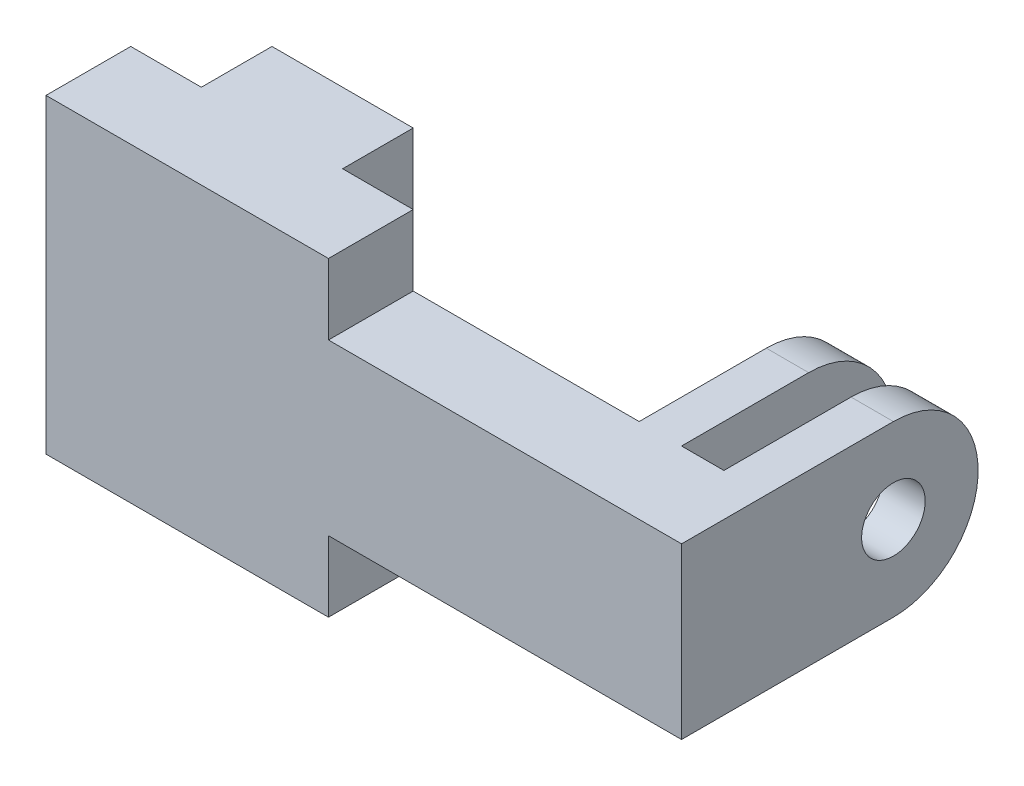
ISO-10303-21;
HEADER;
FILE_DESCRIPTION(('STEP AP214'),'2;1');
FILE_NAME('part.step','',(''),(''),'','','');
FILE_SCHEMA(('AUTOMOTIVE_DESIGN { 1 0 10303 214 1 1 1 1 }'));
ENDSEC;
DATA;
#1=APPLICATION_CONTEXT('core data for automotive mechanical design processes');
#2=APPLICATION_PROTOCOL_DEFINITION('international standard','automotive_design',2000,#1);
#3=PRODUCT_CONTEXT('',#1,'mechanical');
#4=PRODUCT('Part','Part','',(#3));
#5=PRODUCT_RELATED_PRODUCT_CATEGORY('part','',(#4));
#6=PRODUCT_DEFINITION_FORMATION('','',#4);
#7=PRODUCT_DEFINITION_CONTEXT('part definition',#1,'design');
#8=PRODUCT_DEFINITION('design','',#6,#7);
#9=PRODUCT_DEFINITION_SHAPE('','',#8);
#10=(LENGTH_UNIT() NAMED_UNIT(*) SI_UNIT(.MILLI.,.METRE.));
#11=(NAMED_UNIT(*) PLANE_ANGLE_UNIT() SI_UNIT($,.RADIAN.));
#12=(NAMED_UNIT(*) SI_UNIT($,.STERADIAN.) SOLID_ANGLE_UNIT());
#13=UNCERTAINTY_MEASURE_WITH_UNIT(LENGTH_MEASURE(1.E-05),#10,'distance_accuracy_value','');
#14=(GEOMETRIC_REPRESENTATION_CONTEXT(3) GLOBAL_UNCERTAINTY_ASSIGNED_CONTEXT((#13)) GLOBAL_UNIT_ASSIGNED_CONTEXT((#10,
#11,#12)) REPRESENTATION_CONTEXT('',''));
#15=CARTESIAN_POINT('',(0.,0.,0.));
#16=DIRECTION('',(0.,0.,1.));
#17=DIRECTION('',(1.,0.,0.));
#18=AXIS2_PLACEMENT_3D('',#15,#16,#17);
#19=CARTESIAN_POINT('',(0.,0.,0.));
#20=DIRECTION('',(0.,0.,1.));
#21=DIRECTION('',(1.,0.,0.));
#22=AXIS2_PLACEMENT_3D('',#19,#20,#21);
#23=PLANE('',#22);
#24=DIRECTION('',(0.,1.,0.));
#25=VECTOR('',#24,1.);
#26=CARTESIAN_POINT('',(-17.5,11.,0.));
#27=LINE('',#26,#25);
#28=CARTESIAN_POINT('',(-17.5,-11.,0.));
#29=VERTEX_POINT('',#28);
#30=CARTESIAN_POINT('',(-17.5,-7.5,0.));
#31=VERTEX_POINT('',#30);
#32=EDGE_CURVE('E250',#29,#31,#27,.T.);
#33=ORIENTED_EDGE('',*,*,#32,.F.);
#34=DIRECTION('',(1.,0.,0.));
#35=VECTOR('',#34,1.);
#36=CARTESIAN_POINT('',(-22.5,-11.,0.));
#37=LINE('',#36,#35);
#38=CARTESIAN_POINT('',(-22.5,-11.,0.));
#39=VERTEX_POINT('',#38);
#40=EDGE_CURVE('E344',#39,#29,#37,.T.);
#41=ORIENTED_EDGE('',*,*,#40,.F.);
#42=DIRECTION('',(0.,-1.,0.));
#43=VECTOR('',#42,1.);
#44=CARTESIAN_POINT('',(-22.5,-6.,0.));
#45=LINE('',#44,#43);
#46=CARTESIAN_POINT('',(-22.5,11.,0.));
#47=VERTEX_POINT('',#46);
#48=EDGE_CURVE('E341',#47,#39,#45,.T.);
#49=ORIENTED_EDGE('',*,*,#48,.F.);
#50=DIRECTION('',(-1.,0.,0.));
#51=VECTOR('',#50,1.);
#52=CARTESIAN_POINT('',(-22.5,11.,0.));
#53=LINE('',#52,#51);
#54=CARTESIAN_POINT('',(-17.5,11.,0.));
#55=VERTEX_POINT('',#54);
#56=EDGE_CURVE('E338',#55,#47,#53,.T.);
#57=ORIENTED_EDGE('',*,*,#56,.F.);
#58=CARTESIAN_POINT('',(-17.5,7.5,0.));
#59=VERTEX_POINT('',#58);
#60=EDGE_CURVE('E233',#59,#55,#27,.T.);
#61=ORIENTED_EDGE('',*,*,#60,.F.);
#62=DIRECTION('',(-1.,0.,0.));
#63=VECTOR('',#62,1.);
#64=CARTESIAN_POINT('',(22.501,7.49999999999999,0.));
#65=LINE('',#64,#63);
#66=CARTESIAN_POINT('',(-7.50000000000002,7.5,0.));
#67=VERTEX_POINT('',#66);
#68=EDGE_CURVE('E225',#67,#59,#65,.T.);
#69=ORIENTED_EDGE('',*,*,#68,.F.);
#70=DIRECTION('',(0.,-1.,0.));
#71=VECTOR('',#70,1.);
#72=CARTESIAN_POINT('',(-7.50000000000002,11.,0.));
#73=LINE('',#72,#71);
#74=CARTESIAN_POINT('',(-7.50000000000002,11.,0.));
#75=VERTEX_POINT('',#74);
#76=EDGE_CURVE('E230',#75,#67,#73,.T.);
#77=ORIENTED_EDGE('',*,*,#76,.F.);
#78=CARTESIAN_POINT('',(-2.50000000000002,11.,0.));
#79=VERTEX_POINT('',#78);
#80=EDGE_CURVE('E339',#79,#75,#53,.T.);
#81=ORIENTED_EDGE('',*,*,#80,.F.);
#82=DIRECTION('',(0.,1.,0.));
#83=VECTOR('',#82,1.);
#84=CARTESIAN_POINT('',(-2.50000000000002,6.,0.));
#85=LINE('',#84,#83);
#86=CARTESIAN_POINT('',(-2.50000000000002,6.,0.));
#87=VERTEX_POINT('',#86);
#88=EDGE_CURVE('E336',#87,#79,#85,.T.);
#89=ORIENTED_EDGE('',*,*,#88,.F.);
#90=DIRECTION('',(-1.,0.,0.));
#91=VECTOR('',#90,1.);
#92=CARTESIAN_POINT('',(-2.50000000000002,6.,0.));
#93=LINE('',#92,#91);
#94=CARTESIAN_POINT('',(13.5,6.,0.));
#95=VERTEX_POINT('',#94);
#96=EDGE_CURVE('E313',#95,#87,#93,.T.);
#97=ORIENTED_EDGE('',*,*,#96,.F.);
#98=DIRECTION('',(0.,1.,0.));
#99=VECTOR('',#98,1.);
#100=CARTESIAN_POINT('',(13.5,6.,0.));
#101=LINE('',#100,#99);
#102=CARTESIAN_POINT('',(13.5,-6.,0.));
#103=VERTEX_POINT('',#102);
#104=EDGE_CURVE('E295',#103,#95,#101,.T.);
#105=ORIENTED_EDGE('',*,*,#104,.F.);
#106=DIRECTION('',(1.,0.,0.));
#107=VECTOR('',#106,1.);
#108=CARTESIAN_POINT('',(-2.50000000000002,-6.,0.));
#109=LINE('',#108,#107);
#110=CARTESIAN_POINT('',(-2.50000000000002,-6.,0.));
#111=VERTEX_POINT('',#110);
#112=EDGE_CURVE('E318',#111,#103,#109,.T.);
#113=ORIENTED_EDGE('',*,*,#112,.F.);
#114=DIRECTION('',(0.,1.,0.));
#115=VECTOR('',#114,1.);
#116=CARTESIAN_POINT('',(-2.50000000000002,-6.,0.));
#117=LINE('',#116,#115);
#118=CARTESIAN_POINT('',(-2.50000000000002,-11.,0.));
#119=VERTEX_POINT('',#118);
#120=EDGE_CURVE('E347',#119,#111,#117,.T.);
#121=ORIENTED_EDGE('',*,*,#120,.F.);
#122=CARTESIAN_POINT('',(-7.50000000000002,-11.,0.));
#123=VERTEX_POINT('',#122);
#124=EDGE_CURVE('E343',#123,#119,#37,.T.);
#125=ORIENTED_EDGE('',*,*,#124,.F.);
#126=CARTESIAN_POINT('',(-7.50000000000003,-7.5,0.));
#127=VERTEX_POINT('',#126);
#128=EDGE_CURVE('E242',#127,#123,#73,.T.);
#129=ORIENTED_EDGE('',*,*,#128,.F.);
#130=DIRECTION('',(-1.,0.,0.));
#131=VECTOR('',#130,1.);
#132=CARTESIAN_POINT('',(22.501,-7.50000000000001,0.));
#133=LINE('',#132,#131);
#134=EDGE_CURVE('E440',#127,#31,#133,.T.);
#135=ORIENTED_EDGE('',*,*,#134,.T.);
#136=EDGE_LOOP('',(#33,#41,#49,#57,#61,#69,#77,#81,#89,#97,#105,#113,#121,#125,#129,#135));
#137=FACE_BOUND('',#136,.T.);
#138=ADVANCED_FACE('F75',(#137),#23,.F.);
#139=CARTESIAN_POINT('',(22.5,6.,6.));
#140=DIRECTION('',(-1.,0.,0.));
#141=DIRECTION('',(0.,0.,1.));
#142=AXIS2_PLACEMENT_3D('',#139,#140,#141);
#143=PLANE('',#142);
#144=CARTESIAN_POINT('',(22.5,0.,-9.));
#145=DIRECTION('',(1.,0.,0.));
#146=DIRECTION('',(0.,0.,-1.));
#147=AXIS2_PLACEMENT_3D('',#144,#145,#146);
#148=CIRCLE('',#147,2.25);
#149=CARTESIAN_POINT('',(22.5,0.,-11.25));
#150=VERTEX_POINT('',#149);
#151=EDGE_CURVE('E276',#150,#150,#148,.T.);
#152=ORIENTED_EDGE('',*,*,#151,.F.);
#153=EDGE_LOOP('',(#152));
#154=FACE_BOUND('',#153,.T.);
#155=DIRECTION('',(0.,0.,-1.));
#156=VECTOR('',#155,1.);
#157=CARTESIAN_POINT('',(22.5,-6.,6.));
#158=LINE('',#157,#156);
#159=CARTESIAN_POINT('',(22.5,-6.,6.));
#160=VERTEX_POINT('',#159);
#161=CARTESIAN_POINT('',(22.5,-6.,-9.));
#162=VERTEX_POINT('',#161);
#163=EDGE_CURVE('E332',#160,#162,#158,.T.);
#164=ORIENTED_EDGE('',*,*,#163,.T.);
#165=CARTESIAN_POINT('',(22.5,0.,-9.));
#166=DIRECTION('',(1.,0.,0.));
#167=DIRECTION('',(0.,0.,-1.));
#168=AXIS2_PLACEMENT_3D('',#165,#166,#167);
#169=CIRCLE('',#168,6.);
#170=CARTESIAN_POINT('',(22.5,6.,-9.));
#171=VERTEX_POINT('',#170);
#172=EDGE_CURVE('E271',#171,#162,#169,.F.);
#173=ORIENTED_EDGE('',*,*,#172,.F.);
#174=DIRECTION('',(0.,0.,-1.));
#175=VECTOR('',#174,1.);
#176=CARTESIAN_POINT('',(22.5,6.,6.));
#177=LINE('',#176,#175);
#178=CARTESIAN_POINT('',(22.5,6.,6.));
#179=VERTEX_POINT('',#178);
#180=EDGE_CURVE('E12',#179,#171,#177,.T.);
#181=ORIENTED_EDGE('',*,*,#180,.F.);
#182=DIRECTION('',(0.,1.,0.));
#183=VECTOR('',#182,1.);
#184=CARTESIAN_POINT('',(22.5,6.,6.));
#185=LINE('',#184,#183);
#186=EDGE_CURVE('E314',#160,#179,#185,.T.);
#187=ORIENTED_EDGE('',*,*,#186,.F.);
#188=EDGE_LOOP('',(#164,#173,#181,#187));
#189=FACE_BOUND('',#188,.T.);
#190=ADVANCED_FACE('F77',(#154,#189),#143,.F.);
#191=CARTESIAN_POINT('',(-2.50000000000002,-6.,6.));
#192=DIRECTION('',(0.,1.,0.));
#193=DIRECTION('',(0.,0.,1.));
#194=AXIS2_PLACEMENT_3D('',#191,#192,#193);
#195=PLANE('',#194);
#196=DIRECTION('',(1.,0.,0.));
#197=VECTOR('',#196,1.);
#198=CARTESIAN_POINT('',(-22.5,-6.,-9.));
#199=LINE('',#198,#197);
#200=CARTESIAN_POINT('',(19.5,-6.,-9.));
#201=VERTEX_POINT('',#200);
#202=EDGE_CURVE('E267',#201,#162,#199,.T.);
#203=ORIENTED_EDGE('',*,*,#202,.T.);
#204=ORIENTED_EDGE('',*,*,#163,.F.);
#205=DIRECTION('',(1.,0.,0.));
#206=VECTOR('',#205,1.);
#207=CARTESIAN_POINT('',(-2.50000000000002,-6.,6.));
#208=LINE('',#207,#206);
#209=CARTESIAN_POINT('',(-2.50000000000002,-6.,6.));
#210=VERTEX_POINT('',#209);
#211=EDGE_CURVE('E330',#210,#160,#208,.T.);
#212=ORIENTED_EDGE('',*,*,#211,.F.);
#213=DIRECTION('',(0.,0.,-1.));
#214=VECTOR('',#213,1.);
#215=CARTESIAN_POINT('',(-2.50000000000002,-6.,6.));
#216=LINE('',#215,#214);
#217=EDGE_CURVE('E354',#210,#111,#216,.T.);
#218=ORIENTED_EDGE('',*,*,#217,.T.);
#219=ORIENTED_EDGE('',*,*,#112,.T.);
#220=DIRECTION('',(0.,0.,1.));
#221=VECTOR('',#220,1.);
#222=CARTESIAN_POINT('',(13.5,-6.,-15.));
#223=LINE('',#222,#221);
#224=CARTESIAN_POINT('',(13.5,-6.,-9.));
#225=VERTEX_POINT('',#224);
#226=EDGE_CURVE('E302',#225,#103,#223,.T.);
#227=ORIENTED_EDGE('',*,*,#226,.F.);
#228=CARTESIAN_POINT('',(16.5,-6.,-9.));
#229=VERTEX_POINT('',#228);
#230=EDGE_CURVE('E270',#225,#229,#199,.T.);
#231=ORIENTED_EDGE('',*,*,#230,.T.);
#232=DIRECTION('',(0.,0.,1.));
#233=VECTOR('',#232,1.);
#234=CARTESIAN_POINT('',(16.5,-6.,-15.));
#235=LINE('',#234,#233);
#236=CARTESIAN_POINT('',(16.5,-6.,0.));
#237=VERTEX_POINT('',#236);
#238=EDGE_CURVE('E304',#229,#237,#235,.T.);
#239=ORIENTED_EDGE('',*,*,#238,.T.);
#240=CARTESIAN_POINT('',(19.5,-6.,0.));
#241=VERTEX_POINT('',#240);
#242=EDGE_CURVE('E349',#237,#241,#109,.T.);
#243=ORIENTED_EDGE('',*,*,#242,.T.);
#244=DIRECTION('',(0.,0.,1.));
#245=VECTOR('',#244,1.);
#246=CARTESIAN_POINT('',(19.5,-6.,-15.));
#247=LINE('',#246,#245);
#248=EDGE_CURVE('E311',#201,#241,#247,.T.);
#249=ORIENTED_EDGE('',*,*,#248,.F.);
#250=EDGE_LOOP('',(#203,#204,#212,#218,#219,#227,#231,#239,#243,#249));
#251=FACE_BOUND('',#250,.T.);
#252=ADVANCED_FACE('F401',(#251),#195,.F.);
#253=CARTESIAN_POINT('',(19.5,6.,-15.));
#254=DIRECTION('',(1.,0.,0.));
#255=DIRECTION('',(0.,0.,-1.));
#256=AXIS2_PLACEMENT_3D('',#253,#254,#255);
#257=PLANE('',#256);
#258=CARTESIAN_POINT('',(19.5,0.,-9.));
#259=DIRECTION('',(1.,0.,0.));
#260=DIRECTION('',(0.,0.,-1.));
#261=AXIS2_PLACEMENT_3D('',#258,#259,#260);
#262=CIRCLE('',#261,2.25);
#263=CARTESIAN_POINT('',(19.5,0.,-11.25));
#264=VERTEX_POINT('',#263);
#265=EDGE_CURVE('E289',#264,#264,#262,.T.);
#266=ORIENTED_EDGE('',*,*,#265,.T.);
#267=EDGE_LOOP('',(#266));
#268=FACE_BOUND('',#267,.T.);
#269=CARTESIAN_POINT('',(19.5,0.,-9.));
#270=DIRECTION('',(1.,0.,0.));
#271=DIRECTION('',(0.,0.,-1.));
#272=AXIS2_PLACEMENT_3D('',#269,#270,#271);
#273=CIRCLE('',#272,6.);
#274=CARTESIAN_POINT('',(19.5,6.,-9.));
#275=VERTEX_POINT('',#274);
#276=EDGE_CURVE('E284',#275,#201,#273,.F.);
#277=ORIENTED_EDGE('',*,*,#276,.T.);
#278=ORIENTED_EDGE('',*,*,#248,.T.);
#279=DIRECTION('',(0.,1.,0.));
#280=VECTOR('',#279,1.);
#281=CARTESIAN_POINT('',(19.5,6.,0.));
#282=LINE('',#281,#280);
#283=CARTESIAN_POINT('',(19.5,6.,0.));
#284=VERTEX_POINT('',#283);
#285=EDGE_CURVE('E306',#241,#284,#282,.T.);
#286=ORIENTED_EDGE('',*,*,#285,.T.);
#287=DIRECTION('',(0.,0.,1.));
#288=VECTOR('',#287,1.);
#289=CARTESIAN_POINT('',(19.5,6.,-15.));
#290=LINE('',#289,#288);
#291=EDGE_CURVE('E309',#275,#284,#290,.T.);
#292=ORIENTED_EDGE('',*,*,#291,.F.);
#293=EDGE_LOOP('',(#277,#278,#286,#292));
#294=FACE_BOUND('',#293,.T.);
#295=ADVANCED_FACE('F407',(#268,#294),#257,.F.);
#296=CARTESIAN_POINT('',(16.5,6.,-15.));
#297=DIRECTION('',(-1.,0.,0.));
#298=DIRECTION('',(0.,0.,1.));
#299=AXIS2_PLACEMENT_3D('',#296,#297,#298);
#300=PLANE('',#299);
#301=CARTESIAN_POINT('',(16.5,0.,-9.));
#302=DIRECTION('',(-1.,0.,0.));
#303=DIRECTION('',(0.,0.,1.));
#304=AXIS2_PLACEMENT_3D('',#301,#302,#303);
#305=CIRCLE('',#304,2.25);
#306=CARTESIAN_POINT('',(16.5,0.,-11.25));
#307=VERTEX_POINT('',#306);
#308=EDGE_CURVE('E286',#307,#307,#305,.T.);
#309=ORIENTED_EDGE('',*,*,#308,.T.);
#310=EDGE_LOOP('',(#309));
#311=FACE_BOUND('',#310,.T.);
#312=ORIENTED_EDGE('',*,*,#238,.F.);
#313=CARTESIAN_POINT('',(16.5,0.,-9.));
#314=DIRECTION('',(-1.,0.,0.));
#315=DIRECTION('',(0.,0.,1.));
#316=AXIS2_PLACEMENT_3D('',#313,#314,#315);
#317=CIRCLE('',#316,6.);
#318=CARTESIAN_POINT('',(16.5,6.,-9.));
#319=VERTEX_POINT('',#318);
#320=EDGE_CURVE('E281',#229,#319,#317,.F.);
#321=ORIENTED_EDGE('',*,*,#320,.T.);
#322=DIRECTION('',(0.,0.,1.));
#323=VECTOR('',#322,1.);
#324=CARTESIAN_POINT('',(16.5,6.,-15.));
#325=LINE('',#324,#323);
#326=CARTESIAN_POINT('',(16.5,6.,0.));
#327=VERTEX_POINT('',#326);
#328=EDGE_CURVE('E298',#319,#327,#325,.T.);
#329=ORIENTED_EDGE('',*,*,#328,.T.);
#330=DIRECTION('',(0.,-1.,0.));
#331=VECTOR('',#330,1.);
#332=CARTESIAN_POINT('',(16.5,6.,0.));
#333=LINE('',#332,#331);
#334=EDGE_CURVE('E292',#327,#237,#333,.T.);
#335=ORIENTED_EDGE('',*,*,#334,.T.);
#336=EDGE_LOOP('',(#312,#321,#329,#335));
#337=FACE_BOUND('',#336,.T.);
#338=ADVANCED_FACE('F415',(#311,#337),#300,.F.);
#339=CARTESIAN_POINT('',(13.5,6.,-15.));
#340=DIRECTION('',(1.,0.,0.));
#341=DIRECTION('',(0.,0.,-1.));
#342=AXIS2_PLACEMENT_3D('',#339,#340,#341);
#343=PLANE('',#342);
#344=CARTESIAN_POINT('',(13.5,0.,-9.));
#345=DIRECTION('',(1.,0.,0.));
#346=DIRECTION('',(0.,0.,-1.));
#347=AXIS2_PLACEMENT_3D('',#344,#345,#346);
#348=CIRCLE('',#347,2.25);
#349=CARTESIAN_POINT('',(13.5,0.,-11.25));
#350=VERTEX_POINT('',#349);
#351=EDGE_CURVE('E79',#350,#350,#348,.T.);
#352=ORIENTED_EDGE('',*,*,#351,.T.);
#353=EDGE_LOOP('',(#352));
#354=FACE_BOUND('',#353,.T.);
#355=CARTESIAN_POINT('',(13.5,0.,-9.));
#356=DIRECTION('',(1.,0.,0.));
#357=DIRECTION('',(0.,0.,-1.));
#358=AXIS2_PLACEMENT_3D('',#355,#356,#357);
#359=CIRCLE('',#358,6.);
#360=CARTESIAN_POINT('',(13.5,6.,-9.));
#361=VERTEX_POINT('',#360);
#362=EDGE_CURVE('E279',#361,#225,#359,.F.);
#363=ORIENTED_EDGE('',*,*,#362,.T.);
#364=ORIENTED_EDGE('',*,*,#226,.T.);
#365=ORIENTED_EDGE('',*,*,#104,.T.);
#366=DIRECTION('',(0.,0.,1.));
#367=VECTOR('',#366,1.);
#368=CARTESIAN_POINT('',(13.5,6.,-15.));
#369=LINE('',#368,#367);
#370=EDGE_CURVE('E300',#361,#95,#369,.T.);
#371=ORIENTED_EDGE('',*,*,#370,.F.);
#372=EDGE_LOOP('',(#363,#364,#365,#371));
#373=FACE_BOUND('',#372,.T.);
#374=ADVANCED_FACE('F420',(#354,#373),#343,.F.);
#375=ORIENTED_EDGE('',*,*,#334,.F.);
#376=EDGE_CURVE('E333',#284,#327,#93,.T.);
#377=ORIENTED_EDGE('',*,*,#376,.F.);
#378=ORIENTED_EDGE('',*,*,#285,.F.);
#379=ORIENTED_EDGE('',*,*,#242,.F.);
#380=EDGE_LOOP('',(#375,#377,#378,#379));
#381=FACE_BOUND('',#380,.T.);
#382=ADVANCED_FACE('F412',(#381),#23,.F.);
#383=CARTESIAN_POINT('',(-2.50000000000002,6.,6.));
#384=DIRECTION('',(0.,-1.,0.));
#385=DIRECTION('',(0.,0.,-1.));
#386=AXIS2_PLACEMENT_3D('',#383,#384,#385);
#387=PLANE('',#386);
#388=ORIENTED_EDGE('',*,*,#180,.T.);
#389=DIRECTION('',(1.,0.,0.));
#390=VECTOR('',#389,1.);
#391=CARTESIAN_POINT('',(-22.5,6.,-9.));
#392=LINE('',#391,#390);
#393=EDGE_CURVE('E273',#275,#171,#392,.T.);
#394=ORIENTED_EDGE('',*,*,#393,.F.);
#395=ORIENTED_EDGE('',*,*,#291,.T.);
#396=ORIENTED_EDGE('',*,*,#376,.T.);
#397=ORIENTED_EDGE('',*,*,#328,.F.);
#398=EDGE_CURVE('E275',#361,#319,#392,.T.);
#399=ORIENTED_EDGE('',*,*,#398,.F.);
#400=ORIENTED_EDGE('',*,*,#370,.T.);
#401=ORIENTED_EDGE('',*,*,#96,.T.);
#402=DIRECTION('',(0.,0.,-1.));
#403=VECTOR('',#402,1.);
#404=CARTESIAN_POINT('',(-2.50000000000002,6.,6.));
#405=LINE('',#404,#403);
#406=CARTESIAN_POINT('',(-2.50000000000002,6.,6.));
#407=VERTEX_POINT('',#406);
#408=EDGE_CURVE('E84',#407,#87,#405,.T.);
#409=ORIENTED_EDGE('',*,*,#408,.F.);
#410=DIRECTION('',(-1.,0.,0.));
#411=VECTOR('',#410,1.);
#412=CARTESIAN_POINT('',(-2.50000000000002,6.,6.));
#413=LINE('',#412,#411);
#414=EDGE_CURVE('E317',#179,#407,#413,.T.);
#415=ORIENTED_EDGE('',*,*,#414,.F.);
#416=EDGE_LOOP('',(#388,#394,#395,#396,#397,#399,#400,#401,#409,#415));
#417=FACE_BOUND('',#416,.T.);
#418=ADVANCED_FACE('F390',(#417),#387,.F.);
#419=CARTESIAN_POINT('',(-2.50000000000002,6.,6.));
#420=DIRECTION('',(-1.,0.,0.));
#421=DIRECTION('',(0.,0.,1.));
#422=AXIS2_PLACEMENT_3D('',#419,#420,#421);
#423=PLANE('',#422);
#424=ORIENTED_EDGE('',*,*,#88,.T.);
#425=DIRECTION('',(0.,0.,-1.));
#426=VECTOR('',#425,1.);
#427=CARTESIAN_POINT('',(-2.50000000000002,11.,6.));
#428=LINE('',#427,#426);
#429=CARTESIAN_POINT('',(-2.50000000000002,11.,6.));
#430=VERTEX_POINT('',#429);
#431=EDGE_CURVE('E366',#430,#79,#428,.T.);
#432=ORIENTED_EDGE('',*,*,#431,.F.);
#433=DIRECTION('',(0.,1.,0.));
#434=VECTOR('',#433,1.);
#435=CARTESIAN_POINT('',(-2.50000000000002,6.,6.));
#436=LINE('',#435,#434);
#437=EDGE_CURVE('E320',#407,#430,#436,.T.);
#438=ORIENTED_EDGE('',*,*,#437,.F.);
#439=ORIENTED_EDGE('',*,*,#408,.T.);
#440=EDGE_LOOP('',(#424,#432,#438,#439));
#441=FACE_BOUND('',#440,.T.);
#442=ADVANCED_FACE('F374',(#441),#423,.F.);
#443=CARTESIAN_POINT('',(-22.5,11.,6.));
#444=DIRECTION('',(0.,-1.,0.));
#445=DIRECTION('',(0.,0.,-1.));
#446=AXIS2_PLACEMENT_3D('',#443,#444,#445);
#447=PLANE('',#446);
#448=ORIENTED_EDGE('',*,*,#80,.T.);
#449=DIRECTION('',(0.,0.,1.));
#450=VECTOR('',#449,1.);
#451=CARTESIAN_POINT('',(-7.50000000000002,11.,-5.));
#452=LINE('',#451,#450);
#453=CARTESIAN_POINT('',(-7.50000000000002,11.,-5.));
#454=VERTEX_POINT('',#453);
#455=EDGE_CURVE('E248',#454,#75,#452,.T.);
#456=ORIENTED_EDGE('',*,*,#455,.F.);
#457=DIRECTION('',(1.,0.,0.));
#458=VECTOR('',#457,1.);
#459=CARTESIAN_POINT('',(-7.50000000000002,11.,-5.));
#460=LINE('',#459,#458);
#461=CARTESIAN_POINT('',(-17.5,11.,-5.));
#462=VERTEX_POINT('',#461);
#463=EDGE_CURVE('E253',#462,#454,#460,.T.);
#464=ORIENTED_EDGE('',*,*,#463,.F.);
#465=DIRECTION('',(0.,0.,1.));
#466=VECTOR('',#465,1.);
#467=CARTESIAN_POINT('',(-17.5,11.,-5.));
#468=LINE('',#467,#466);
#469=EDGE_CURVE('E259',#462,#55,#468,.T.);
#470=ORIENTED_EDGE('',*,*,#469,.T.);
#471=ORIENTED_EDGE('',*,*,#56,.T.);
#472=DIRECTION('',(0.,0.,-1.));
#473=VECTOR('',#472,1.);
#474=CARTESIAN_POINT('',(-22.5,11.,6.));
#475=LINE('',#474,#473);
#476=CARTESIAN_POINT('',(-22.5,11.,6.));
#477=VERTEX_POINT('',#476);
#478=EDGE_CURVE('E363',#477,#47,#475,.T.);
#479=ORIENTED_EDGE('',*,*,#478,.F.);
#480=DIRECTION('',(-1.,0.,0.));
#481=VECTOR('',#480,1.);
#482=CARTESIAN_POINT('',(-22.5,11.,6.));
#483=LINE('',#482,#481);
#484=EDGE_CURVE('E322',#430,#477,#483,.T.);
#485=ORIENTED_EDGE('',*,*,#484,.F.);
#486=ORIENTED_EDGE('',*,*,#431,.T.);
#487=EDGE_LOOP('',(#448,#456,#464,#470,#471,#479,#485,#486));
#488=FACE_BOUND('',#487,.T.);
#489=ADVANCED_FACE('F380',(#488),#447,.F.);
#490=CARTESIAN_POINT('',(-22.5,-6.,6.));
#491=DIRECTION('',(1.,0.,0.));
#492=DIRECTION('',(0.,1.,0.));
#493=AXIS2_PLACEMENT_3D('',#490,#491,#492);
#494=PLANE('',#493);
#495=ORIENTED_EDGE('',*,*,#48,.T.);
#496=DIRECTION('',(0.,0.,-1.));
#497=VECTOR('',#496,1.);
#498=CARTESIAN_POINT('',(-22.5,-11.,6.));
#499=LINE('',#498,#497);
#500=CARTESIAN_POINT('',(-22.5,-11.,6.));
#501=VERTEX_POINT('',#500);
#502=EDGE_CURVE('E360',#501,#39,#499,.T.);
#503=ORIENTED_EDGE('',*,*,#502,.F.);
#504=DIRECTION('',(0.,-1.,0.));
#505=VECTOR('',#504,1.);
#506=CARTESIAN_POINT('',(-22.5,6.,6.));
#507=LINE('',#506,#505);
#508=EDGE_CURVE('E324',#477,#501,#507,.T.);
#509=ORIENTED_EDGE('',*,*,#508,.F.);
#510=ORIENTED_EDGE('',*,*,#478,.T.);
#511=EDGE_LOOP('',(#495,#503,#509,#510));
#512=FACE_BOUND('',#511,.T.);
#513=ADVANCED_FACE('F456',(#512),#494,.F.);
#514=CARTESIAN_POINT('',(-22.5,-11.,6.));
#515=DIRECTION('',(0.,1.,0.));
#516=DIRECTION('',(0.,0.,1.));
#517=AXIS2_PLACEMENT_3D('',#514,#515,#516);
#518=PLANE('',#517);
#519=ORIENTED_EDGE('',*,*,#40,.T.);
#520=DIRECTION('',(0.,0.,1.));
#521=VECTOR('',#520,1.);
#522=CARTESIAN_POINT('',(-17.5,-11.,-5.));
#523=LINE('',#522,#521);
#524=CARTESIAN_POINT('',(-17.5,-11.,-5.));
#525=VERTEX_POINT('',#524);
#526=EDGE_CURVE('E262',#525,#29,#523,.T.);
#527=ORIENTED_EDGE('',*,*,#526,.F.);
#528=DIRECTION('',(-1.,0.,0.));
#529=VECTOR('',#528,1.);
#530=CARTESIAN_POINT('',(-7.50000000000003,-11.,-5.));
#531=LINE('',#530,#529);
#532=CARTESIAN_POINT('',(-7.50000000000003,-11.,-5.));
#533=VERTEX_POINT('',#532);
#534=EDGE_CURVE('E438',#533,#525,#531,.T.);
#535=ORIENTED_EDGE('',*,*,#534,.F.);
#536=DIRECTION('',(0.,0.,1.));
#537=VECTOR('',#536,1.);
#538=CARTESIAN_POINT('',(-7.50000000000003,-11.,-5.));
#539=LINE('',#538,#537);
#540=EDGE_CURVE('E264',#533,#123,#539,.T.);
#541=ORIENTED_EDGE('',*,*,#540,.T.);
#542=ORIENTED_EDGE('',*,*,#124,.T.);
#543=DIRECTION('',(0.,0.,-1.));
#544=VECTOR('',#543,1.);
#545=CARTESIAN_POINT('',(-2.50000000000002,-11.,6.));
#546=LINE('',#545,#544);
#547=CARTESIAN_POINT('',(-2.50000000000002,-11.,6.));
#548=VERTEX_POINT('',#547);
#549=EDGE_CURVE('E357',#548,#119,#546,.T.);
#550=ORIENTED_EDGE('',*,*,#549,.F.);
#551=DIRECTION('',(1.,0.,0.));
#552=VECTOR('',#551,1.);
#553=CARTESIAN_POINT('',(-22.5,-11.,6.));
#554=LINE('',#553,#552);
#555=EDGE_CURVE('E326',#501,#548,#554,.T.);
#556=ORIENTED_EDGE('',*,*,#555,.F.);
#557=ORIENTED_EDGE('',*,*,#502,.T.);
#558=EDGE_LOOP('',(#519,#527,#535,#541,#542,#550,#556,#557));
#559=FACE_BOUND('',#558,.T.);
#560=ADVANCED_FACE('F434',(#559),#518,.F.);
#561=CARTESIAN_POINT('',(-2.50000000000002,-6.,6.));
#562=DIRECTION('',(-1.,0.,0.));
#563=DIRECTION('',(0.,0.,1.));
#564=AXIS2_PLACEMENT_3D('',#561,#562,#563);
#565=PLANE('',#564);
#566=ORIENTED_EDGE('',*,*,#120,.T.);
#567=ORIENTED_EDGE('',*,*,#217,.F.);
#568=DIRECTION('',(0.,1.,0.));
#569=VECTOR('',#568,1.);
#570=CARTESIAN_POINT('',(-2.50000000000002,-6.,6.));
#571=LINE('',#570,#569);
#572=EDGE_CURVE('E328',#548,#210,#571,.T.);
#573=ORIENTED_EDGE('',*,*,#572,.F.);
#574=ORIENTED_EDGE('',*,*,#549,.T.);
#575=EDGE_LOOP('',(#566,#567,#573,#574));
#576=FACE_BOUND('',#575,.T.);
#577=ADVANCED_FACE('F429',(#576),#565,.F.);
#578=CARTESIAN_POINT('',(0.,0.,6.));
#579=DIRECTION('',(0.,0.,1.));
#580=DIRECTION('',(1.,0.,0.));
#581=AXIS2_PLACEMENT_3D('',#578,#579,#580);
#582=PLANE('',#581);
#583=ORIENTED_EDGE('',*,*,#186,.T.);
#584=ORIENTED_EDGE('',*,*,#414,.T.);
#585=ORIENTED_EDGE('',*,*,#437,.T.);
#586=ORIENTED_EDGE('',*,*,#484,.T.);
#587=ORIENTED_EDGE('',*,*,#508,.T.);
#588=ORIENTED_EDGE('',*,*,#555,.T.);
#589=ORIENTED_EDGE('',*,*,#572,.T.);
#590=ORIENTED_EDGE('',*,*,#211,.T.);
#591=EDGE_LOOP('',(#583,#584,#585,#586,#587,#588,#589,#590));
#592=FACE_BOUND('',#591,.T.);
#593=ADVANCED_FACE('F386',(#592),#582,.T.);
#594=CARTESIAN_POINT('',(-22.5,0.,-9.));
#595=DIRECTION('',(1.,0.,0.));
#596=DIRECTION('',(0.,0.,-1.));
#597=AXIS2_PLACEMENT_3D('',#594,#595,#596);
#598=CYLINDRICAL_SURFACE('',#597,6.);
#599=ORIENTED_EDGE('',*,*,#320,.F.);
#600=ORIENTED_EDGE('',*,*,#230,.F.);
#601=ORIENTED_EDGE('',*,*,#362,.F.);
#602=ORIENTED_EDGE('',*,*,#398,.T.);
#603=EDGE_LOOP('',(#599,#600,#601,#602));
#604=FACE_BOUND('',#603,.T.);
#605=ADVANCED_FACE('F500',(#604),#598,.T.);
#606=CARTESIAN_POINT('',(-22.5,0.,-9.));
#607=DIRECTION('',(1.,0.,0.));
#608=DIRECTION('',(0.,0.,-1.));
#609=AXIS2_PLACEMENT_3D('',#606,#607,#608);
#610=CYLINDRICAL_SURFACE('',#609,2.25);
#611=CARTESIAN_POINT('',(13.5,0.,-11.25));
#612=CARTESIAN_POINT('',(13.53125,0.,-11.25));
#613=CARTESIAN_POINT('',(13.5625,0.,-11.25));
#614=CARTESIAN_POINT('',(13.625,0.,-11.25));
#615=CARTESIAN_POINT('',(13.65625,0.,-11.25));
#616=CARTESIAN_POINT('',(13.71875,0.,-11.25));
#617=CARTESIAN_POINT('',(13.75,0.,-11.25));
#618=CARTESIAN_POINT('',(13.8125,0.,-11.25));
#619=CARTESIAN_POINT('',(13.84375,0.,-11.25));
#620=CARTESIAN_POINT('',(13.90625,0.,-11.25));
#621=CARTESIAN_POINT('',(13.9375,0.,-11.25));
#622=CARTESIAN_POINT('',(14.,0.,-11.25));
#623=CARTESIAN_POINT('',(14.03125,0.,-11.25));
#624=CARTESIAN_POINT('',(14.09375,0.,-11.25));
#625=CARTESIAN_POINT('',(14.125,0.,-11.25));
#626=CARTESIAN_POINT('',(14.1875,0.,-11.25));
#627=CARTESIAN_POINT('',(14.21875,0.,-11.25));
#628=CARTESIAN_POINT('',(14.28125,0.,-11.25));
#629=CARTESIAN_POINT('',(14.3125,0.,-11.25));
#630=CARTESIAN_POINT('',(14.375,0.,-11.25));
#631=CARTESIAN_POINT('',(14.40625,0.,-11.25));
#632=CARTESIAN_POINT('',(14.46875,0.,-11.25));
#633=CARTESIAN_POINT('',(14.5,0.,-11.25));
#634=CARTESIAN_POINT('',(14.5625,0.,-11.25));
#635=CARTESIAN_POINT('',(14.59375,0.,-11.25));
#636=CARTESIAN_POINT('',(14.65625,0.,-11.25));
#637=CARTESIAN_POINT('',(14.6875,0.,-11.25));
#638=CARTESIAN_POINT('',(14.75,0.,-11.25));
#639=CARTESIAN_POINT('',(14.78125,0.,-11.25));
#640=CARTESIAN_POINT('',(14.84375,0.,-11.25));
#641=CARTESIAN_POINT('',(14.875,0.,-11.25));
#642=CARTESIAN_POINT('',(14.9375,0.,-11.25));
#643=CARTESIAN_POINT('',(14.96875,0.,-11.25));
#644=CARTESIAN_POINT('',(15.03125,0.,-11.25));
#645=CARTESIAN_POINT('',(15.0625,0.,-11.25));
#646=CARTESIAN_POINT('',(15.125,0.,-11.25));
#647=CARTESIAN_POINT('',(15.15625,0.,-11.25));
#648=CARTESIAN_POINT('',(15.21875,0.,-11.25));
#649=CARTESIAN_POINT('',(15.25,0.,-11.25));
#650=CARTESIAN_POINT('',(15.3125,0.,-11.25));
#651=CARTESIAN_POINT('',(15.34375,0.,-11.25));
#652=CARTESIAN_POINT('',(15.40625,0.,-11.25));
#653=CARTESIAN_POINT('',(15.4375,0.,-11.25));
#654=CARTESIAN_POINT('',(15.5,0.,-11.25));
#655=CARTESIAN_POINT('',(15.53125,0.,-11.25));
#656=CARTESIAN_POINT('',(15.59375,0.,-11.25));
#657=CARTESIAN_POINT('',(15.625,0.,-11.25));
#658=CARTESIAN_POINT('',(15.6875,0.,-11.25));
#659=CARTESIAN_POINT('',(15.71875,0.,-11.25));
#660=CARTESIAN_POINT('',(15.78125,0.,-11.25));
#661=CARTESIAN_POINT('',(15.8125,0.,-11.25));
#662=CARTESIAN_POINT('',(15.875,0.,-11.25));
#663=CARTESIAN_POINT('',(15.90625,0.,-11.25));
#664=CARTESIAN_POINT('',(15.96875,0.,-11.25));
#665=CARTESIAN_POINT('',(16.,0.,-11.25));
#666=CARTESIAN_POINT('',(16.0625,0.,-11.25));
#667=CARTESIAN_POINT('',(16.09375,0.,-11.25));
#668=CARTESIAN_POINT('',(16.15625,0.,-11.25));
#669=CARTESIAN_POINT('',(16.1875,0.,-11.25));
#670=CARTESIAN_POINT('',(16.25,0.,-11.25));
#671=CARTESIAN_POINT('',(16.28125,0.,-11.25));
#672=CARTESIAN_POINT('',(16.34375,0.,-11.25));
#673=CARTESIAN_POINT('',(16.375,0.,-11.25));
#674=CARTESIAN_POINT('',(16.4375,0.,-11.25));
#675=CARTESIAN_POINT('',(16.46875,0.,-11.25));
#676=CARTESIAN_POINT('',(16.5,0.,-11.25));
#677=B_SPLINE_CURVE_WITH_KNOTS('',3,(#611,#612,#613,#614,#615,#616,#617,#618,#619,#620,#621,
#622,#623,#624,#625,#626,#627,#628,#629,#630,#631,#632,#633,#634,#635,#636,#637,#638,#639,#640,
#641,#642,#643,#644,#645,#646,#647,#648,#649,#650,#651,#652,#653,#654,#655,#656,#657,#658,#659,
#660,#661,#662,#663,#664,#665,#666,#667,#668,#669,#670,#671,#672,#673,#674,#675,#676),
.UNSPECIFIED.,.F.,.F.,(4,2,2,2,2,2,2,2,2,2,2,2,2,2,2,2,2,2,2,2,2,2,2,2,2,2,2,2,2,2,2,2,4),(0.,
0.0937500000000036,0.1875,0.281249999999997,0.375,0.468750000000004,0.5625,0.656249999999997,
0.750000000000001,0.843750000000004,0.937500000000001,1.03125,1.125,1.21875,1.3125,1.40625,1.5,
1.59375,1.6875,1.78125,1.875,1.96875000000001,2.0625,2.15625,2.25,2.34375000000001,2.4375,
2.53125,2.625,2.71875000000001,2.8125,2.90625,3.),.UNSPECIFIED.);
#678=EDGE_CURVE('BSEAM505',#350,#307,#677,.T.);
#679=ORIENTED_EDGE('',*,*,#351,.F.);
#680=ORIENTED_EDGE('',*,*,#308,.F.);
#681=ORIENTED_EDGE('',*,*,#678,.T.);
#682=ORIENTED_EDGE('',*,*,#678,.F.);
#683=EDGE_LOOP('',(#679,#681,#680,#682));
#684=FACE_BOUND('',#683,.T.);
#685=ADVANCED_FACE('F505',(#684),#610,.F.);
#686=ORIENTED_EDGE('',*,*,#393,.T.);
#687=ORIENTED_EDGE('',*,*,#172,.T.);
#688=ORIENTED_EDGE('',*,*,#202,.F.);
#689=ORIENTED_EDGE('',*,*,#276,.F.);
#690=EDGE_LOOP('',(#686,#687,#688,#689));
#691=FACE_BOUND('',#690,.T.);
#692=ADVANCED_FACE('F398',(#691),#598,.T.);
#693=CARTESIAN_POINT('',(22.5,0.,-11.25));
#694=CARTESIAN_POINT('',(22.46875,0.,-11.25));
#695=CARTESIAN_POINT('',(22.4375,0.,-11.25));
#696=CARTESIAN_POINT('',(22.375,0.,-11.25));
#697=CARTESIAN_POINT('',(22.34375,0.,-11.25));
#698=CARTESIAN_POINT('',(22.28125,0.,-11.25));
#699=CARTESIAN_POINT('',(22.25,0.,-11.25));
#700=CARTESIAN_POINT('',(22.1875,0.,-11.25));
#701=CARTESIAN_POINT('',(22.15625,0.,-11.25));
#702=CARTESIAN_POINT('',(22.09375,0.,-11.25));
#703=CARTESIAN_POINT('',(22.0625,0.,-11.25));
#704=CARTESIAN_POINT('',(22.,0.,-11.25));
#705=CARTESIAN_POINT('',(21.96875,0.,-11.25));
#706=CARTESIAN_POINT('',(21.90625,0.,-11.25));
#707=CARTESIAN_POINT('',(21.875,0.,-11.25));
#708=CARTESIAN_POINT('',(21.8125,0.,-11.25));
#709=CARTESIAN_POINT('',(21.78125,0.,-11.25));
#710=CARTESIAN_POINT('',(21.71875,0.,-11.25));
#711=CARTESIAN_POINT('',(21.6875,0.,-11.25));
#712=CARTESIAN_POINT('',(21.625,0.,-11.25));
#713=CARTESIAN_POINT('',(21.59375,0.,-11.25));
#714=CARTESIAN_POINT('',(21.53125,0.,-11.25));
#715=CARTESIAN_POINT('',(21.5,0.,-11.25));
#716=CARTESIAN_POINT('',(21.4375,0.,-11.25));
#717=CARTESIAN_POINT('',(21.40625,0.,-11.25));
#718=CARTESIAN_POINT('',(21.34375,0.,-11.25));
#719=CARTESIAN_POINT('',(21.3125,0.,-11.25));
#720=CARTESIAN_POINT('',(21.25,0.,-11.25));
#721=CARTESIAN_POINT('',(21.21875,0.,-11.25));
#722=CARTESIAN_POINT('',(21.15625,0.,-11.25));
#723=CARTESIAN_POINT('',(21.125,0.,-11.25));
#724=CARTESIAN_POINT('',(21.0625,0.,-11.25));
#725=CARTESIAN_POINT('',(21.03125,0.,-11.25));
#726=CARTESIAN_POINT('',(20.96875,0.,-11.25));
#727=CARTESIAN_POINT('',(20.9375,0.,-11.25));
#728=CARTESIAN_POINT('',(20.875,0.,-11.25));
#729=CARTESIAN_POINT('',(20.84375,0.,-11.25));
#730=CARTESIAN_POINT('',(20.78125,0.,-11.25));
#731=CARTESIAN_POINT('',(20.75,0.,-11.25));
#732=CARTESIAN_POINT('',(20.6875,0.,-11.25));
#733=CARTESIAN_POINT('',(20.65625,0.,-11.25));
#734=CARTESIAN_POINT('',(20.59375,0.,-11.25));
#735=CARTESIAN_POINT('',(20.5625,0.,-11.25));
#736=CARTESIAN_POINT('',(20.5,0.,-11.25));
#737=CARTESIAN_POINT('',(20.46875,0.,-11.25));
#738=CARTESIAN_POINT('',(20.40625,0.,-11.25));
#739=CARTESIAN_POINT('',(20.375,0.,-11.25));
#740=CARTESIAN_POINT('',(20.3125,0.,-11.25));
#741=CARTESIAN_POINT('',(20.28125,0.,-11.25));
#742=CARTESIAN_POINT('',(20.21875,0.,-11.25));
#743=CARTESIAN_POINT('',(20.1875,0.,-11.25));
#744=CARTESIAN_POINT('',(20.125,0.,-11.25));
#745=CARTESIAN_POINT('',(20.09375,0.,-11.25));
#746=CARTESIAN_POINT('',(20.03125,0.,-11.25));
#747=CARTESIAN_POINT('',(20.,0.,-11.25));
#748=CARTESIAN_POINT('',(19.9375,0.,-11.25));
#749=CARTESIAN_POINT('',(19.90625,0.,-11.25));
#750=CARTESIAN_POINT('',(19.84375,0.,-11.25));
#751=CARTESIAN_POINT('',(19.8125,0.,-11.25));
#752=CARTESIAN_POINT('',(19.75,0.,-11.25));
#753=CARTESIAN_POINT('',(19.71875,0.,-11.25));
#754=CARTESIAN_POINT('',(19.65625,0.,-11.25));
#755=CARTESIAN_POINT('',(19.625,0.,-11.25));
#756=CARTESIAN_POINT('',(19.5625,0.,-11.25));
#757=CARTESIAN_POINT('',(19.53125,0.,-11.25));
#758=CARTESIAN_POINT('',(19.5,0.,-11.25));
#759=B_SPLINE_CURVE_WITH_KNOTS('',3,(#693,#694,#695,#696,#697,#698,#699,#700,#701,#702,#703,
#704,#705,#706,#707,#708,#709,#710,#711,#712,#713,#714,#715,#716,#717,#718,#719,#720,#721,#722,
#723,#724,#725,#726,#727,#728,#729,#730,#731,#732,#733,#734,#735,#736,#737,#738,#739,#740,#741,
#742,#743,#744,#745,#746,#747,#748,#749,#750,#751,#752,#753,#754,#755,#756,#757,#758),
.UNSPECIFIED.,.F.,.F.,(4,2,2,2,2,2,2,2,2,2,2,2,2,2,2,2,2,2,2,2,2,2,2,2,2,2,2,2,2,2,2,2,4),(0.,
0.0937500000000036,0.1875,0.281249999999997,0.375,0.468750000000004,0.5625,0.656249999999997,
0.750000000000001,0.843750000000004,0.937500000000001,1.03125,1.125,1.21875,1.3125,1.40625,1.5,
1.59375,1.6875,1.78125,1.875,1.96875000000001,2.0625,2.15625,2.25,2.34375000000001,2.4375,
2.53125,2.625,2.71875000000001,2.8125,2.90625,3.),.UNSPECIFIED.);
#760=EDGE_CURVE('BSEAM470',#150,#264,#759,.T.);
#761=ORIENTED_EDGE('',*,*,#151,.T.);
#762=ORIENTED_EDGE('',*,*,#265,.F.);
#763=ORIENTED_EDGE('',*,*,#760,.T.);
#764=ORIENTED_EDGE('',*,*,#760,.F.);
#765=EDGE_LOOP('',(#761,#763,#762,#764));
#766=FACE_BOUND('',#765,.T.);
#767=ADVANCED_FACE('F470',(#766),#610,.F.);
#768=CARTESIAN_POINT('',(-7.50000000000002,11.,-5.));
#769=DIRECTION('',(-1.,0.,0.));
#770=DIRECTION('',(0.,-1.,0.));
#771=AXIS2_PLACEMENT_3D('',#768,#769,#770);
#772=PLANE('',#771);
#773=ORIENTED_EDGE('',*,*,#76,.T.);
#774=DIRECTION('',(0.,0.,1.));
#775=VECTOR('',#774,1.);
#776=CARTESIAN_POINT('',(-7.50000000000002,7.5,0.));
#777=LINE('',#776,#775);
#778=CARTESIAN_POINT('',(-7.50000000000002,7.5,-2.));
#779=VERTEX_POINT('',#778);
#780=EDGE_CURVE('E237',#779,#67,#777,.T.);
#781=ORIENTED_EDGE('',*,*,#780,.F.);
#782=DIRECTION('',(0.,1.,0.));
#783=VECTOR('',#782,1.);
#784=CARTESIAN_POINT('',(-7.50000000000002,7.5,-2.));
#785=LINE('',#784,#783);
#786=CARTESIAN_POINT('',(-7.50000000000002,-7.5,-2.));
#787=VERTEX_POINT('',#786);
#788=EDGE_CURVE('E243',#787,#779,#785,.T.);
#789=ORIENTED_EDGE('',*,*,#788,.F.);
#790=DIRECTION('',(0.,0.,1.));
#791=VECTOR('',#790,1.);
#792=CARTESIAN_POINT('',(-7.50000000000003,-7.5,0.));
#793=LINE('',#792,#791);
#794=EDGE_CURVE('E91',#787,#127,#793,.T.);
#795=ORIENTED_EDGE('',*,*,#794,.T.);
#796=ORIENTED_EDGE('',*,*,#128,.T.);
#797=ORIENTED_EDGE('',*,*,#540,.F.);
#798=DIRECTION('',(0.,-1.,0.));
#799=VECTOR('',#798,1.);
#800=CARTESIAN_POINT('',(-7.50000000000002,11.,-5.));
#801=LINE('',#800,#799);
#802=EDGE_CURVE('E257',#454,#533,#801,.T.);
#803=ORIENTED_EDGE('',*,*,#802,.F.);
#804=ORIENTED_EDGE('',*,*,#455,.T.);
#805=EDGE_LOOP('',(#773,#781,#789,#795,#796,#797,#803,#804));
#806=FACE_BOUND('',#805,.T.);
#807=ADVANCED_FACE('F245',(#806),#772,.F.);
#808=CARTESIAN_POINT('',(-17.5,11.,-5.));
#809=DIRECTION('',(1.,0.,0.));
#810=DIRECTION('',(0.,1.,0.));
#811=AXIS2_PLACEMENT_3D('',#808,#809,#810);
#812=PLANE('',#811);
#813=DIRECTION('',(0.,-1.,0.));
#814=VECTOR('',#813,1.);
#815=CARTESIAN_POINT('',(-17.5,7.5,-2.));
#816=LINE('',#815,#814);
#817=CARTESIAN_POINT('',(-17.5,7.5,-2.));
#818=VERTEX_POINT('',#817);
#819=CARTESIAN_POINT('',(-17.5,-7.5,-2.));
#820=VERTEX_POINT('',#819);
#821=EDGE_CURVE('E461',#818,#820,#816,.T.);
#822=ORIENTED_EDGE('',*,*,#821,.F.);
#823=DIRECTION('',(0.,0.,-1.));
#824=VECTOR('',#823,1.);
#825=CARTESIAN_POINT('',(-17.5,7.5,0.));
#826=LINE('',#825,#824);
#827=EDGE_CURVE('E99',#59,#818,#826,.T.);
#828=ORIENTED_EDGE('',*,*,#827,.F.);
#829=ORIENTED_EDGE('',*,*,#60,.T.);
#830=ORIENTED_EDGE('',*,*,#469,.F.);
#831=DIRECTION('',(0.,1.,0.));
#832=VECTOR('',#831,1.);
#833=CARTESIAN_POINT('',(-17.5,11.,-5.));
#834=LINE('',#833,#832);
#835=EDGE_CURVE('E447',#525,#462,#834,.T.);
#836=ORIENTED_EDGE('',*,*,#835,.F.);
#837=ORIENTED_EDGE('',*,*,#526,.T.);
#838=ORIENTED_EDGE('',*,*,#32,.T.);
#839=DIRECTION('',(0.,0.,-1.));
#840=VECTOR('',#839,1.);
#841=CARTESIAN_POINT('',(-17.5,-7.5,0.));
#842=LINE('',#841,#840);
#843=EDGE_CURVE('E442',#31,#820,#842,.T.);
#844=ORIENTED_EDGE('',*,*,#843,.T.);
#845=EDGE_LOOP('',(#822,#828,#829,#830,#836,#837,#838,#844));
#846=FACE_BOUND('',#845,.T.);
#847=ADVANCED_FACE('F458',(#846),#812,.F.);
#848=CARTESIAN_POINT('',(0.,0.,-5.));
#849=DIRECTION('',(0.,0.,-1.));
#850=DIRECTION('',(-1.,0.,0.));
#851=AXIS2_PLACEMENT_3D('',#848,#849,#850);
#852=PLANE('',#851);
#853=ORIENTED_EDGE('',*,*,#802,.T.);
#854=ORIENTED_EDGE('',*,*,#534,.T.);
#855=ORIENTED_EDGE('',*,*,#835,.T.);
#856=ORIENTED_EDGE('',*,*,#463,.T.);
#857=EDGE_LOOP('',(#853,#854,#855,#856));
#858=FACE_BOUND('',#857,.T.);
#859=ADVANCED_FACE('F451',(#858),#852,.T.);
#860=CARTESIAN_POINT('',(22.501,7.49999999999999,0.));
#861=DIRECTION('',(0.,1.,0.));
#862=DIRECTION('',(-1.,0.,0.));
#863=AXIS2_PLACEMENT_3D('',#860,#861,#862);
#864=PLANE('',#863);
#865=ORIENTED_EDGE('',*,*,#780,.T.);
#866=ORIENTED_EDGE('',*,*,#68,.T.);
#867=ORIENTED_EDGE('',*,*,#827,.T.);
#868=DIRECTION('',(-1.,0.,0.));
#869=VECTOR('',#868,1.);
#870=CARTESIAN_POINT('',(22.501,7.49999999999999,-2.));
#871=LINE('',#870,#869);
#872=EDGE_CURVE('E234',#779,#818,#871,.T.);
#873=ORIENTED_EDGE('',*,*,#872,.F.);
#874=EDGE_LOOP('',(#865,#866,#867,#873));
#875=FACE_BOUND('',#874,.T.);
#876=ADVANCED_FACE('F238',(#875),#864,.F.);
#877=CARTESIAN_POINT('',(22.501,-7.50000000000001,0.));
#878=DIRECTION('',(0.,1.,0.));
#879=DIRECTION('',(-1.,0.,0.));
#880=AXIS2_PLACEMENT_3D('',#877,#878,#879);
#881=PLANE('',#880);
#882=DIRECTION('',(-1.,0.,0.));
#883=VECTOR('',#882,1.);
#884=CARTESIAN_POINT('',(22.501,-7.50000000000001,-2.));
#885=LINE('',#884,#883);
#886=EDGE_CURVE('E704',#787,#820,#885,.T.);
#887=ORIENTED_EDGE('',*,*,#886,.T.);
#888=ORIENTED_EDGE('',*,*,#843,.F.);
#889=ORIENTED_EDGE('',*,*,#134,.F.);
#890=ORIENTED_EDGE('',*,*,#794,.F.);
#891=EDGE_LOOP('',(#887,#888,#889,#890));
#892=FACE_BOUND('',#891,.T.);
#893=ADVANCED_FACE('F683',(#892),#881,.T.);
#894=CARTESIAN_POINT('',(22.501,7.49999999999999,-2.));
#895=DIRECTION('',(0.,0.,-1.));
#896=DIRECTION('',(0.,1.,0.));
#897=AXIS2_PLACEMENT_3D('',#894,#895,#896);
#898=PLANE('',#897);
#899=ORIENTED_EDGE('',*,*,#788,.T.);
#900=ORIENTED_EDGE('',*,*,#872,.T.);
#901=ORIENTED_EDGE('',*,*,#821,.T.);
#902=ORIENTED_EDGE('',*,*,#886,.F.);
#903=EDGE_LOOP('',(#899,#900,#901,#902));
#904=FACE_BOUND('',#903,.T.);
#905=ADVANCED_FACE('F691',(#904),#898,.F.);
#906=CLOSED_SHELL('',(#138,#190,#252,#295,#338,#374,#382,#418,#442,#489,#513,#560,#577,#593,
#605,#685,#692,#767,#807,#847,#859,#876,#893,#905));
#907=MANIFOLD_SOLID_BREP('B2',#906);
#908=ADVANCED_BREP_SHAPE_REPRESENTATION('',(#18,#907),#14);
#909=SHAPE_DEFINITION_REPRESENTATION(#9,#908);
ENDSEC;
END-ISO-10303-21;
